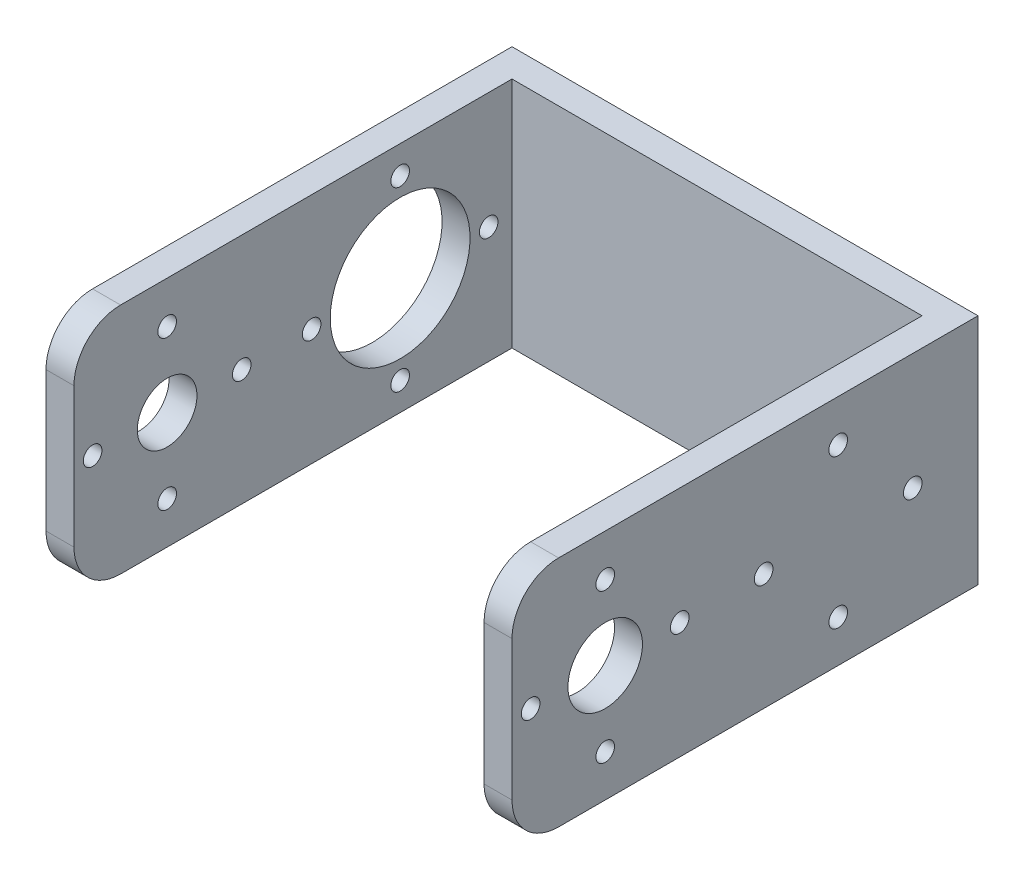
ISO-10303-21;
HEADER;
FILE_DESCRIPTION(('STEP AP214'),'2;1');
FILE_NAME('part.step','',(''),(''),'','','');
FILE_SCHEMA(('AUTOMOTIVE_DESIGN { 1 0 10303 214 1 1 1 1 }'));
ENDSEC;
DATA;
#1=APPLICATION_CONTEXT('core data for automotive mechanical design processes');
#2=APPLICATION_PROTOCOL_DEFINITION('international standard','automotive_design',2000,#1);
#3=PRODUCT_CONTEXT('',#1,'mechanical');
#4=PRODUCT('Part','Part','',(#3));
#5=PRODUCT_RELATED_PRODUCT_CATEGORY('part','',(#4));
#6=PRODUCT_DEFINITION_FORMATION('','',#4);
#7=PRODUCT_DEFINITION_CONTEXT('part definition',#1,'design');
#8=PRODUCT_DEFINITION('design','',#6,#7);
#9=PRODUCT_DEFINITION_SHAPE('','',#8);
#10=(LENGTH_UNIT() NAMED_UNIT(*) SI_UNIT(.MILLI.,.METRE.));
#11=(NAMED_UNIT(*) PLANE_ANGLE_UNIT() SI_UNIT($,.RADIAN.));
#12=(NAMED_UNIT(*) SI_UNIT($,.STERADIAN.) SOLID_ANGLE_UNIT());
#13=UNCERTAINTY_MEASURE_WITH_UNIT(LENGTH_MEASURE(1.E-05),#10,'distance_accuracy_value','');
#14=(GEOMETRIC_REPRESENTATION_CONTEXT(3) GLOBAL_UNCERTAINTY_ASSIGNED_CONTEXT((#13)) GLOBAL_UNIT_ASSIGNED_CONTEXT((#10,
#11,#12)) REPRESENTATION_CONTEXT('',''));
#15=CARTESIAN_POINT('',(0.,0.,0.));
#16=DIRECTION('',(0.,0.,1.));
#17=DIRECTION('',(1.,0.,0.));
#18=AXIS2_PLACEMENT_3D('',#15,#16,#17);
#19=CARTESIAN_POINT('',(27.,25.,-25.));
#20=DIRECTION('',(-1.,0.,0.));
#21=DIRECTION('',(0.,0.,1.));
#22=AXIS2_PLACEMENT_3D('',#19,#20,#21);
#23=PLANE('',#22);
#24=CARTESIAN_POINT('',(27.,12.5,15.));
#25=DIRECTION('',(1.,0.,0.));
#26=DIRECTION('',(0.,0.,-1.));
#27=AXIS2_PLACEMENT_3D('',#24,#25,#26);
#28=CIRCLE('',#27,4.);
#29=CARTESIAN_POINT('',(27.,12.5,11.));
#30=VERTEX_POINT('',#29);
#31=EDGE_CURVE('E315',#30,#30,#28,.T.);
#32=ORIENTED_EDGE('',*,*,#31,.F.);
#33=EDGE_LOOP('',(#32));
#34=FACE_BOUND('',#33,.T.);
#35=CARTESIAN_POINT('',(27.,4.5,-9.99999999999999));
#36=DIRECTION('',(1.,0.,0.));
#37=DIRECTION('',(0.,0.,-1.));
#38=AXIS2_PLACEMENT_3D('',#35,#36,#37);
#39=CIRCLE('',#38,1.);
#40=CARTESIAN_POINT('',(27.,4.5,-11.));
#41=VERTEX_POINT('',#40);
#42=EDGE_CURVE('E314',#41,#41,#39,.T.);
#43=ORIENTED_EDGE('',*,*,#42,.F.);
#44=EDGE_LOOP('',(#43));
#45=FACE_BOUND('',#44,.T.);
#46=CARTESIAN_POINT('',(27.,12.5,-2.));
#47=DIRECTION('',(1.,0.,0.));
#48=DIRECTION('',(0.,0.,-1.));
#49=AXIS2_PLACEMENT_3D('',#46,#47,#48);
#50=CIRCLE('',#49,1.);
#51=CARTESIAN_POINT('',(27.,12.5,-3.));
#52=VERTEX_POINT('',#51);
#53=EDGE_CURVE('E299',#52,#52,#50,.T.);
#54=ORIENTED_EDGE('',*,*,#53,.F.);
#55=EDGE_LOOP('',(#54));
#56=FACE_BOUND('',#55,.T.);
#57=CARTESIAN_POINT('',(27.,12.5,-18.));
#58=DIRECTION('',(1.,0.,0.));
#59=DIRECTION('',(0.,0.,-1.));
#60=AXIS2_PLACEMENT_3D('',#57,#58,#59);
#61=CIRCLE('',#60,1.);
#62=CARTESIAN_POINT('',(27.,12.5,-19.));
#63=VERTEX_POINT('',#62);
#64=EDGE_CURVE('E306',#63,#63,#61,.T.);
#65=ORIENTED_EDGE('',*,*,#64,.F.);
#66=EDGE_LOOP('',(#65));
#67=FACE_BOUND('',#66,.T.);
#68=CARTESIAN_POINT('',(27.,12.5,22.9999999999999));
#69=DIRECTION('',(1.,0.,0.));
#70=DIRECTION('',(0.,0.,-1.));
#71=AXIS2_PLACEMENT_3D('',#68,#69,#70);
#72=CIRCLE('',#71,1.);
#73=CARTESIAN_POINT('',(27.,12.5,21.9999999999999));
#74=VERTEX_POINT('',#73);
#75=EDGE_CURVE('E339',#74,#74,#72,.T.);
#76=ORIENTED_EDGE('',*,*,#75,.F.);
#77=EDGE_LOOP('',(#76));
#78=FACE_BOUND('',#77,.T.);
#79=CARTESIAN_POINT('',(27.,4.5,14.9999999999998));
#80=DIRECTION('',(1.,0.,0.));
#81=DIRECTION('',(0.,0.,-1.));
#82=AXIS2_PLACEMENT_3D('',#79,#80,#81);
#83=CIRCLE('',#82,1.);
#84=CARTESIAN_POINT('',(27.,4.5,13.9999999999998));
#85=VERTEX_POINT('',#84);
#86=EDGE_CURVE('E338',#85,#85,#83,.T.);
#87=ORIENTED_EDGE('',*,*,#86,.F.);
#88=EDGE_LOOP('',(#87));
#89=FACE_BOUND('',#88,.T.);
#90=CARTESIAN_POINT('',(27.,12.5000000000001,6.99999999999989));
#91=DIRECTION('',(1.,0.,0.));
#92=DIRECTION('',(0.,0.,-1.));
#93=AXIS2_PLACEMENT_3D('',#90,#91,#92);
#94=CIRCLE('',#93,1.);
#95=CARTESIAN_POINT('',(27.,12.5000000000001,5.99999999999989));
#96=VERTEX_POINT('',#95);
#97=EDGE_CURVE('E327',#96,#96,#94,.T.);
#98=ORIENTED_EDGE('',*,*,#97,.F.);
#99=EDGE_LOOP('',(#98));
#100=FACE_BOUND('',#99,.T.);
#101=CARTESIAN_POINT('',(27.,20.5,15.));
#102=DIRECTION('',(1.,0.,0.));
#103=DIRECTION('',(0.,0.,-1.));
#104=AXIS2_PLACEMENT_3D('',#101,#102,#103);
#105=CIRCLE('',#104,1.);
#106=CARTESIAN_POINT('',(27.,20.5,14.));
#107=VERTEX_POINT('',#106);
#108=EDGE_CURVE('E326',#107,#107,#105,.T.);
#109=ORIENTED_EDGE('',*,*,#108,.F.);
#110=EDGE_LOOP('',(#109));
#111=FACE_BOUND('',#110,.T.);
#112=CARTESIAN_POINT('',(27.,20.5,-10.));
#113=DIRECTION('',(1.,0.,0.));
#114=DIRECTION('',(0.,0.,-1.));
#115=AXIS2_PLACEMENT_3D('',#112,#113,#114);
#116=CIRCLE('',#115,1.);
#117=CARTESIAN_POINT('',(27.,20.5,-11.));
#118=VERTEX_POINT('',#117);
#119=EDGE_CURVE('E293',#118,#118,#116,.T.);
#120=ORIENTED_EDGE('',*,*,#119,.F.);
#121=EDGE_LOOP('',(#120));
#122=FACE_BOUND('',#121,.T.);
#123=DIRECTION('',(0.,-1.,0.));
#124=VECTOR('',#123,1.);
#125=CARTESIAN_POINT('',(27.,25.,25.));
#126=LINE('',#125,#124);
#127=CARTESIAN_POINT('',(27.,20.,25.));
#128=VERTEX_POINT('',#127);
#129=CARTESIAN_POINT('',(27.,5.,25.));
#130=VERTEX_POINT('',#129);
#131=EDGE_CURVE('E214',#128,#130,#126,.T.);
#132=ORIENTED_EDGE('',*,*,#131,.T.);
#133=CARTESIAN_POINT('',(27.,5.,20.));
#134=DIRECTION('',(-1.,0.,0.));
#135=DIRECTION('',(0.,0.,1.));
#136=AXIS2_PLACEMENT_3D('',#133,#134,#135);
#137=CIRCLE('',#136,5.);
#138=CARTESIAN_POINT('',(27.,0.,20.));
#139=VERTEX_POINT('',#138);
#140=EDGE_CURVE('E168',#130,#139,#137,.F.);
#141=ORIENTED_EDGE('',*,*,#140,.T.);
#142=DIRECTION('',(0.,0.,-1.));
#143=VECTOR('',#142,1.);
#144=CARTESIAN_POINT('',(27.,0.,-25.));
#145=LINE('',#144,#143);
#146=CARTESIAN_POINT('',(27.,0.,-25.));
#147=VERTEX_POINT('',#146);
#148=EDGE_CURVE('E154',#139,#147,#145,.T.);
#149=ORIENTED_EDGE('',*,*,#148,.T.);
#150=DIRECTION('',(0.,-1.,0.));
#151=VECTOR('',#150,1.);
#152=CARTESIAN_POINT('',(27.,25.,-25.));
#153=LINE('',#152,#151);
#154=CARTESIAN_POINT('',(27.,25.,-25.));
#155=VERTEX_POINT('',#154);
#156=EDGE_CURVE('E146',#155,#147,#153,.T.);
#157=ORIENTED_EDGE('',*,*,#156,.F.);
#158=DIRECTION('',(0.,0.,-1.));
#159=VECTOR('',#158,1.);
#160=CARTESIAN_POINT('',(27.,25.,-25.));
#161=LINE('',#160,#159);
#162=CARTESIAN_POINT('',(27.,25.,20.));
#163=VERTEX_POINT('',#162);
#164=EDGE_CURVE('E130',#163,#155,#161,.T.);
#165=ORIENTED_EDGE('',*,*,#164,.F.);
#166=CARTESIAN_POINT('',(27.,20.,20.));
#167=DIRECTION('',(-1.,0.,0.));
#168=DIRECTION('',(0.,0.,1.));
#169=AXIS2_PLACEMENT_3D('',#166,#167,#168);
#170=CIRCLE('',#169,5.);
#171=EDGE_CURVE('E166',#163,#128,#170,.F.);
#172=ORIENTED_EDGE('',*,*,#171,.T.);
#173=EDGE_LOOP('',(#132,#141,#149,#157,#165,#172));
#174=FACE_BOUND('',#173,.T.);
#175=ADVANCED_FACE('F41',(#34,#45,#56,#67,#78,#89,#100,#111,#122,#174),#23,.F.);
#176=CARTESIAN_POINT('',(-23.,25.,-25.));
#177=DIRECTION('',(0.,0.,1.));
#178=DIRECTION('',(1.,0.,0.));
#179=AXIS2_PLACEMENT_3D('',#176,#177,#178);
#180=PLANE('',#179);
#181=DIRECTION('',(-1.,0.,0.));
#182=VECTOR('',#181,1.);
#183=CARTESIAN_POINT('',(-23.,0.,-25.));
#184=LINE('',#183,#182);
#185=CARTESIAN_POINT('',(-23.,0.,-25.));
#186=VERTEX_POINT('',#185);
#187=EDGE_CURVE('E225',#147,#186,#184,.T.);
#188=ORIENTED_EDGE('',*,*,#187,.T.);
#189=DIRECTION('',(0.,-1.,0.));
#190=VECTOR('',#189,1.);
#191=CARTESIAN_POINT('',(-23.,25.,-25.));
#192=LINE('',#191,#190);
#193=CARTESIAN_POINT('',(-23.,25.,-25.));
#194=VERTEX_POINT('',#193);
#195=EDGE_CURVE('E148',#194,#186,#192,.T.);
#196=ORIENTED_EDGE('',*,*,#195,.F.);
#197=DIRECTION('',(-1.,0.,0.));
#198=VECTOR('',#197,1.);
#199=CARTESIAN_POINT('',(-23.,25.,-25.));
#200=LINE('',#199,#198);
#201=EDGE_CURVE('E135',#155,#194,#200,.T.);
#202=ORIENTED_EDGE('',*,*,#201,.F.);
#203=ORIENTED_EDGE('',*,*,#156,.T.);
#204=EDGE_LOOP('',(#188,#196,#202,#203));
#205=FACE_BOUND('',#204,.T.);
#206=ADVANCED_FACE('F145',(#205),#180,.F.);
#207=CARTESIAN_POINT('',(-23.,25.,25.));
#208=DIRECTION('',(1.,0.,0.));
#209=DIRECTION('',(0.,0.,-1.));
#210=AXIS2_PLACEMENT_3D('',#207,#208,#209);
#211=PLANE('',#210);
#212=CARTESIAN_POINT('',(-23.,12.5,-19.5));
#213=DIRECTION('',(-1.,0.,0.));
#214=DIRECTION('',(0.,0.,1.));
#215=AXIS2_PLACEMENT_3D('',#212,#213,#214);
#216=CIRCLE('',#215,1.);
#217=CARTESIAN_POINT('',(-23.,12.5,-18.5));
#218=VERTEX_POINT('',#217);
#219=EDGE_CURVE('E250',#218,#218,#216,.T.);
#220=ORIENTED_EDGE('',*,*,#219,.F.);
#221=EDGE_LOOP('',(#220));
#222=FACE_BOUND('',#221,.T.);
#223=CARTESIAN_POINT('',(-23.,3.,-10.));
#224=DIRECTION('',(-1.,0.,0.));
#225=DIRECTION('',(0.,0.,1.));
#226=AXIS2_PLACEMENT_3D('',#223,#224,#225);
#227=CIRCLE('',#226,1.);
#228=CARTESIAN_POINT('',(-23.,3.,-9.));
#229=VERTEX_POINT('',#228);
#230=EDGE_CURVE('E280',#229,#229,#227,.T.);
#231=ORIENTED_EDGE('',*,*,#230,.F.);
#232=EDGE_LOOP('',(#231));
#233=FACE_BOUND('',#232,.T.);
#234=CARTESIAN_POINT('',(-23.,12.5,-0.500000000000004));
#235=DIRECTION('',(-1.,0.,0.));
#236=DIRECTION('',(0.,0.,1.));
#237=AXIS2_PLACEMENT_3D('',#234,#235,#236);
#238=CIRCLE('',#237,1.);
#239=CARTESIAN_POINT('',(-23.,12.5,0.499999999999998));
#240=VERTEX_POINT('',#239);
#241=EDGE_CURVE('E269',#240,#240,#238,.T.);
#242=ORIENTED_EDGE('',*,*,#241,.F.);
#243=EDGE_LOOP('',(#242));
#244=FACE_BOUND('',#243,.T.);
#245=CARTESIAN_POINT('',(-23.,22.,-10.));
#246=DIRECTION('',(-1.,0.,0.));
#247=DIRECTION('',(0.,0.,1.));
#248=AXIS2_PLACEMENT_3D('',#245,#246,#247);
#249=CIRCLE('',#248,1.);
#250=CARTESIAN_POINT('',(-23.,22.,-9.));
#251=VERTEX_POINT('',#250);
#252=EDGE_CURVE('E268',#251,#251,#249,.T.);
#253=ORIENTED_EDGE('',*,*,#252,.F.);
#254=EDGE_LOOP('',(#253));
#255=FACE_BOUND('',#254,.T.);
#256=CARTESIAN_POINT('',(-23.,4.5,15.0000000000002));
#257=DIRECTION('',(-1.,0.,0.));
#258=DIRECTION('',(0.,0.,1.));
#259=AXIS2_PLACEMENT_3D('',#256,#257,#258);
#260=CIRCLE('',#259,1.);
#261=CARTESIAN_POINT('',(-23.,4.5,16.0000000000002));
#262=VERTEX_POINT('',#261);
#263=EDGE_CURVE('E257',#262,#262,#260,.T.);
#264=ORIENTED_EDGE('',*,*,#263,.F.);
#265=EDGE_LOOP('',(#264));
#266=FACE_BOUND('',#265,.T.);
#267=CARTESIAN_POINT('',(-23.,12.5000000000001,23.0000000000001));
#268=DIRECTION('',(-1.,0.,0.));
#269=DIRECTION('',(0.,0.,1.));
#270=AXIS2_PLACEMENT_3D('',#267,#268,#269);
#271=CIRCLE('',#270,1.);
#272=CARTESIAN_POINT('',(-23.,12.5000000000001,24.0000000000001));
#273=VERTEX_POINT('',#272);
#274=EDGE_CURVE('E256',#273,#273,#271,.T.);
#275=ORIENTED_EDGE('',*,*,#274,.F.);
#276=EDGE_LOOP('',(#275));
#277=FACE_BOUND('',#276,.T.);
#278=CARTESIAN_POINT('',(-23.,20.5,15.));
#279=DIRECTION('',(-1.,0.,0.));
#280=DIRECTION('',(0.,0.,1.));
#281=AXIS2_PLACEMENT_3D('',#278,#279,#280);
#282=CIRCLE('',#281,1.);
#283=CARTESIAN_POINT('',(-23.,20.5,16.));
#284=VERTEX_POINT('',#283);
#285=EDGE_CURVE('E243',#284,#284,#282,.T.);
#286=ORIENTED_EDGE('',*,*,#285,.F.);
#287=EDGE_LOOP('',(#286));
#288=FACE_BOUND('',#287,.T.);
#289=CARTESIAN_POINT('',(-23.,12.5,15.));
#290=DIRECTION('',(-1.,0.,0.));
#291=DIRECTION('',(0.,0.,1.));
#292=AXIS2_PLACEMENT_3D('',#289,#290,#291);
#293=CIRCLE('',#292,3.2);
#294=CARTESIAN_POINT('',(-23.,12.5,18.2));
#295=VERTEX_POINT('',#294);
#296=EDGE_CURVE('E242',#295,#295,#293,.T.);
#297=ORIENTED_EDGE('',*,*,#296,.F.);
#298=EDGE_LOOP('',(#297));
#299=FACE_BOUND('',#298,.T.);
#300=CARTESIAN_POINT('',(-23.,12.5,7.0000000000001));
#301=DIRECTION('',(-1.,0.,0.));
#302=DIRECTION('',(0.,0.,1.));
#303=AXIS2_PLACEMENT_3D('',#300,#301,#302);
#304=CIRCLE('',#303,1.);
#305=CARTESIAN_POINT('',(-23.,12.5,8.00000000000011));
#306=VERTEX_POINT('',#305);
#307=EDGE_CURVE('E289',#306,#306,#304,.T.);
#308=ORIENTED_EDGE('',*,*,#307,.F.);
#309=EDGE_LOOP('',(#308));
#310=FACE_BOUND('',#309,.T.);
#311=CARTESIAN_POINT('',(-23.,12.5,-10.));
#312=DIRECTION('',(-1.,0.,0.));
#313=DIRECTION('',(0.,0.,1.));
#314=AXIS2_PLACEMENT_3D('',#311,#312,#313);
#315=CIRCLE('',#314,7.5);
#316=CARTESIAN_POINT('',(-23.,12.5,-2.5));
#317=VERTEX_POINT('',#316);
#318=EDGE_CURVE('E235',#317,#317,#315,.T.);
#319=ORIENTED_EDGE('',*,*,#318,.F.);
#320=EDGE_LOOP('',(#319));
#321=FACE_BOUND('',#320,.T.);
#322=DIRECTION('',(0.,0.,1.));
#323=VECTOR('',#322,1.);
#324=CARTESIAN_POINT('',(-23.,0.,25.));
#325=LINE('',#324,#323);
#326=CARTESIAN_POINT('',(-23.,0.,20.));
#327=VERTEX_POINT('',#326);
#328=EDGE_CURVE('E223',#186,#327,#325,.T.);
#329=ORIENTED_EDGE('',*,*,#328,.T.);
#330=CARTESIAN_POINT('',(-23.,5.,20.));
#331=DIRECTION('',(1.,0.,0.));
#332=DIRECTION('',(0.,0.,-1.));
#333=AXIS2_PLACEMENT_3D('',#330,#331,#332);
#334=CIRCLE('',#333,5.);
#335=CARTESIAN_POINT('',(-23.,5.,25.));
#336=VERTEX_POINT('',#335);
#337=EDGE_CURVE('E11',#327,#336,#334,.F.);
#338=ORIENTED_EDGE('',*,*,#337,.T.);
#339=DIRECTION('',(0.,-1.,0.));
#340=VECTOR('',#339,1.);
#341=CARTESIAN_POINT('',(-23.,25.,25.));
#342=LINE('',#341,#340);
#343=CARTESIAN_POINT('',(-23.,20.,25.));
#344=VERTEX_POINT('',#343);
#345=EDGE_CURVE('E160',#344,#336,#342,.T.);
#346=ORIENTED_EDGE('',*,*,#345,.F.);
#347=CARTESIAN_POINT('',(-23.,20.,20.));
#348=DIRECTION('',(1.,0.,0.));
#349=DIRECTION('',(0.,0.,-1.));
#350=AXIS2_PLACEMENT_3D('',#347,#348,#349);
#351=CIRCLE('',#350,5.);
#352=CARTESIAN_POINT('',(-23.,25.,20.));
#353=VERTEX_POINT('',#352);
#354=EDGE_CURVE('E49',#344,#353,#351,.F.);
#355=ORIENTED_EDGE('',*,*,#354,.T.);
#356=DIRECTION('',(0.,0.,1.));
#357=VECTOR('',#356,1.);
#358=CARTESIAN_POINT('',(-23.,25.,25.));
#359=LINE('',#358,#357);
#360=EDGE_CURVE('E150',#194,#353,#359,.T.);
#361=ORIENTED_EDGE('',*,*,#360,.F.);
#362=ORIENTED_EDGE('',*,*,#195,.T.);
#363=EDGE_LOOP('',(#329,#338,#346,#355,#361,#362));
#364=FACE_BOUND('',#363,.T.);
#365=ADVANCED_FACE('F190',(#222,#233,#244,#255,#266,#277,#288,#299,#310,#321,#364),#211,.F.);
#366=CARTESIAN_POINT('',(-20.,25.,25.));
#367=DIRECTION('',(0.,0.,-1.));
#368=DIRECTION('',(-1.,0.,0.));
#369=AXIS2_PLACEMENT_3D('',#366,#367,#368);
#370=PLANE('',#369);
#371=ORIENTED_EDGE('',*,*,#345,.T.);
#372=DIRECTION('',(1.,0.,0.));
#373=VECTOR('',#372,1.);
#374=CARTESIAN_POINT('',(-20.,5.,25.));
#375=LINE('',#374,#373);
#376=CARTESIAN_POINT('',(-20.,5.,25.));
#377=VERTEX_POINT('',#376);
#378=EDGE_CURVE('E183',#336,#377,#375,.T.);
#379=ORIENTED_EDGE('',*,*,#378,.T.);
#380=DIRECTION('',(0.,-1.,0.));
#381=VECTOR('',#380,1.);
#382=CARTESIAN_POINT('',(-20.,25.,25.));
#383=LINE('',#382,#381);
#384=CARTESIAN_POINT('',(-20.,20.,25.));
#385=VERTEX_POINT('',#384);
#386=EDGE_CURVE('E199',#385,#377,#383,.T.);
#387=ORIENTED_EDGE('',*,*,#386,.F.);
#388=DIRECTION('',(1.,0.,0.));
#389=VECTOR('',#388,1.);
#390=CARTESIAN_POINT('',(-20.,20.,25.));
#391=LINE('',#390,#389);
#392=EDGE_CURVE('E61',#385,#344,#391,.F.);
#393=ORIENTED_EDGE('',*,*,#392,.T.);
#394=EDGE_LOOP('',(#371,#379,#387,#393));
#395=FACE_BOUND('',#394,.T.);
#396=ADVANCED_FACE('F201',(#395),#370,.F.);
#397=CARTESIAN_POINT('',(-20.,25.,-22.));
#398=DIRECTION('',(-1.,0.,0.));
#399=DIRECTION('',(0.,0.,1.));
#400=AXIS2_PLACEMENT_3D('',#397,#398,#399);
#401=PLANE('',#400);
#402=CARTESIAN_POINT('',(-20.,12.5,-19.5));
#403=DIRECTION('',(-1.,0.,0.));
#404=DIRECTION('',(0.,0.,1.));
#405=AXIS2_PLACEMENT_3D('',#402,#403,#404);
#406=CIRCLE('',#405,1.);
#407=CARTESIAN_POINT('',(-20.,12.5,-18.5));
#408=VERTEX_POINT('',#407);
#409=EDGE_CURVE('E277',#408,#408,#406,.F.);
#410=ORIENTED_EDGE('',*,*,#409,.F.);
#411=EDGE_LOOP('',(#410));
#412=FACE_BOUND('',#411,.T.);
#413=CARTESIAN_POINT('',(-20.,3.,-10.));
#414=DIRECTION('',(-1.,0.,0.));
#415=DIRECTION('',(0.,0.,1.));
#416=AXIS2_PLACEMENT_3D('',#413,#414,#415);
#417=CIRCLE('',#416,1.);
#418=CARTESIAN_POINT('',(-20.,3.,-9.));
#419=VERTEX_POINT('',#418);
#420=EDGE_CURVE('E272',#419,#419,#417,.F.);
#421=ORIENTED_EDGE('',*,*,#420,.F.);
#422=EDGE_LOOP('',(#421));
#423=FACE_BOUND('',#422,.T.);
#424=CARTESIAN_POINT('',(-20.,12.5,-0.500000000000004));
#425=DIRECTION('',(-1.,0.,0.));
#426=DIRECTION('',(0.,0.,1.));
#427=AXIS2_PLACEMENT_3D('',#424,#425,#426);
#428=CIRCLE('',#427,1.);
#429=CARTESIAN_POINT('',(-20.,12.5,0.499999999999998));
#430=VERTEX_POINT('',#429);
#431=EDGE_CURVE('E265',#430,#430,#428,.F.);
#432=ORIENTED_EDGE('',*,*,#431,.F.);
#433=EDGE_LOOP('',(#432));
#434=FACE_BOUND('',#433,.T.);
#435=CARTESIAN_POINT('',(-20.,22.,-10.));
#436=DIRECTION('',(-1.,0.,0.));
#437=DIRECTION('',(0.,0.,1.));
#438=AXIS2_PLACEMENT_3D('',#435,#436,#437);
#439=CIRCLE('',#438,1.);
#440=CARTESIAN_POINT('',(-20.,22.,-9.));
#441=VERTEX_POINT('',#440);
#442=EDGE_CURVE('E238',#441,#441,#439,.F.);
#443=ORIENTED_EDGE('',*,*,#442,.F.);
#444=EDGE_LOOP('',(#443));
#445=FACE_BOUND('',#444,.T.);
#446=CARTESIAN_POINT('',(-20.,4.5,15.0000000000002));
#447=DIRECTION('',(-1.,0.,0.));
#448=DIRECTION('',(0.,0.,1.));
#449=AXIS2_PLACEMENT_3D('',#446,#447,#448);
#450=CIRCLE('',#449,1.);
#451=CARTESIAN_POINT('',(-20.,4.5,16.0000000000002));
#452=VERTEX_POINT('',#451);
#453=EDGE_CURVE('E253',#452,#452,#450,.F.);
#454=ORIENTED_EDGE('',*,*,#453,.F.);
#455=EDGE_LOOP('',(#454));
#456=FACE_BOUND('',#455,.T.);
#457=CARTESIAN_POINT('',(-20.,12.5000000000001,23.0000000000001));
#458=DIRECTION('',(-1.,0.,0.));
#459=DIRECTION('',(0.,0.,1.));
#460=AXIS2_PLACEMENT_3D('',#457,#458,#459);
#461=CIRCLE('',#460,1.);
#462=CARTESIAN_POINT('',(-20.,12.5000000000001,24.0000000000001));
#463=VERTEX_POINT('',#462);
#464=EDGE_CURVE('E246',#463,#463,#461,.F.);
#465=ORIENTED_EDGE('',*,*,#464,.F.);
#466=EDGE_LOOP('',(#465));
#467=FACE_BOUND('',#466,.T.);
#468=CARTESIAN_POINT('',(-20.,20.5,15.));
#469=DIRECTION('',(-1.,0.,0.));
#470=DIRECTION('',(0.,0.,1.));
#471=AXIS2_PLACEMENT_3D('',#468,#469,#470);
#472=CIRCLE('',#471,1.);
#473=CARTESIAN_POINT('',(-20.,20.5,16.));
#474=VERTEX_POINT('',#473);
#475=EDGE_CURVE('E239',#474,#474,#472,.F.);
#476=ORIENTED_EDGE('',*,*,#475,.F.);
#477=EDGE_LOOP('',(#476));
#478=FACE_BOUND('',#477,.T.);
#479=CARTESIAN_POINT('',(-20.,12.5,15.));
#480=DIRECTION('',(-1.,0.,0.));
#481=DIRECTION('',(0.,0.,1.));
#482=AXIS2_PLACEMENT_3D('',#479,#480,#481);
#483=CIRCLE('',#482,3.2);
#484=CARTESIAN_POINT('',(-20.,12.5,18.2));
#485=VERTEX_POINT('',#484);
#486=EDGE_CURVE('E247',#485,#485,#483,.F.);
#487=ORIENTED_EDGE('',*,*,#486,.F.);
#488=EDGE_LOOP('',(#487));
#489=FACE_BOUND('',#488,.T.);
#490=CARTESIAN_POINT('',(-20.,12.5,7.0000000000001));
#491=DIRECTION('',(-1.,0.,0.));
#492=DIRECTION('',(0.,0.,1.));
#493=AXIS2_PLACEMENT_3D('',#490,#491,#492);
#494=CIRCLE('',#493,1.);
#495=CARTESIAN_POINT('',(-20.,12.5,8.00000000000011));
#496=VERTEX_POINT('',#495);
#497=EDGE_CURVE('E260',#496,#496,#494,.F.);
#498=ORIENTED_EDGE('',*,*,#497,.F.);
#499=EDGE_LOOP('',(#498));
#500=FACE_BOUND('',#499,.T.);
#501=CARTESIAN_POINT('',(-20.,12.5,-10.));
#502=DIRECTION('',(-1.,0.,0.));
#503=DIRECTION('',(0.,0.,1.));
#504=AXIS2_PLACEMENT_3D('',#501,#502,#503);
#505=CIRCLE('',#504,7.5);
#506=CARTESIAN_POINT('',(-20.,12.5,-2.5));
#507=VERTEX_POINT('',#506);
#508=EDGE_CURVE('E228',#507,#507,#505,.F.);
#509=ORIENTED_EDGE('',*,*,#508,.F.);
#510=EDGE_LOOP('',(#509));
#511=FACE_BOUND('',#510,.T.);
#512=ORIENTED_EDGE('',*,*,#386,.T.);
#513=CARTESIAN_POINT('',(-20.,5.,20.));
#514=DIRECTION('',(-1.,0.,0.));
#515=DIRECTION('',(0.,0.,1.));
#516=AXIS2_PLACEMENT_3D('',#513,#514,#515);
#517=CIRCLE('',#516,5.);
#518=CARTESIAN_POINT('',(-20.,0.,20.));
#519=VERTEX_POINT('',#518);
#520=EDGE_CURVE('E188',#377,#519,#517,.F.);
#521=ORIENTED_EDGE('',*,*,#520,.T.);
#522=DIRECTION('',(0.,0.,-1.));
#523=VECTOR('',#522,1.);
#524=CARTESIAN_POINT('',(-20.,0.,-22.));
#525=LINE('',#524,#523);
#526=CARTESIAN_POINT('',(-20.,0.,-22.));
#527=VERTEX_POINT('',#526);
#528=EDGE_CURVE('E221',#519,#527,#525,.T.);
#529=ORIENTED_EDGE('',*,*,#528,.T.);
#530=DIRECTION('',(0.,-1.,0.));
#531=VECTOR('',#530,1.);
#532=CARTESIAN_POINT('',(-20.,25.,-22.));
#533=LINE('',#532,#531);
#534=CARTESIAN_POINT('',(-20.,25.,-22.));
#535=VERTEX_POINT('',#534);
#536=EDGE_CURVE('E203',#535,#527,#533,.T.);
#537=ORIENTED_EDGE('',*,*,#536,.F.);
#538=DIRECTION('',(0.,0.,-1.));
#539=VECTOR('',#538,1.);
#540=CARTESIAN_POINT('',(-20.,25.,-22.));
#541=LINE('',#540,#539);
#542=CARTESIAN_POINT('',(-20.,25.,20.));
#543=VERTEX_POINT('',#542);
#544=EDGE_CURVE('E194',#543,#535,#541,.T.);
#545=ORIENTED_EDGE('',*,*,#544,.F.);
#546=CARTESIAN_POINT('',(-20.,20.,20.));
#547=DIRECTION('',(-1.,0.,0.));
#548=DIRECTION('',(0.,0.,1.));
#549=AXIS2_PLACEMENT_3D('',#546,#547,#548);
#550=CIRCLE('',#549,5.);
#551=EDGE_CURVE('E186',#543,#385,#550,.F.);
#552=ORIENTED_EDGE('',*,*,#551,.T.);
#553=EDGE_LOOP('',(#512,#521,#529,#537,#545,#552));
#554=FACE_BOUND('',#553,.T.);
#555=ADVANCED_FACE('F198',(#412,#423,#434,#445,#456,#467,#478,#489,#500,#511,#554),#401,.F.);
#556=CARTESIAN_POINT('',(24.,25.,-22.));
#557=DIRECTION('',(0.,0.,-1.));
#558=DIRECTION('',(-1.,0.,0.));
#559=AXIS2_PLACEMENT_3D('',#556,#557,#558);
#560=PLANE('',#559);
#561=DIRECTION('',(1.,0.,0.));
#562=VECTOR('',#561,1.);
#563=CARTESIAN_POINT('',(24.,0.,-22.));
#564=LINE('',#563,#562);
#565=CARTESIAN_POINT('',(24.,0.,-22.));
#566=VERTEX_POINT('',#565);
#567=EDGE_CURVE('E219',#527,#566,#564,.T.);
#568=ORIENTED_EDGE('',*,*,#567,.T.);
#569=DIRECTION('',(0.,-1.,0.));
#570=VECTOR('',#569,1.);
#571=CARTESIAN_POINT('',(24.,25.,-22.));
#572=LINE('',#571,#570);
#573=CARTESIAN_POINT('',(24.,25.,-22.));
#574=VERTEX_POINT('',#573);
#575=EDGE_CURVE('E206',#574,#566,#572,.T.);
#576=ORIENTED_EDGE('',*,*,#575,.F.);
#577=DIRECTION('',(1.,0.,0.));
#578=VECTOR('',#577,1.);
#579=CARTESIAN_POINT('',(24.,25.,-22.));
#580=LINE('',#579,#578);
#581=EDGE_CURVE('E230',#535,#574,#580,.T.);
#582=ORIENTED_EDGE('',*,*,#581,.F.);
#583=ORIENTED_EDGE('',*,*,#536,.T.);
#584=EDGE_LOOP('',(#568,#576,#582,#583));
#585=FACE_BOUND('',#584,.T.);
#586=ADVANCED_FACE('F372',(#585),#560,.F.);
#587=CARTESIAN_POINT('',(24.,25.,25.));
#588=DIRECTION('',(1.,0.,0.));
#589=DIRECTION('',(0.,0.,-1.));
#590=AXIS2_PLACEMENT_3D('',#587,#588,#589);
#591=PLANE('',#590);
#592=CARTESIAN_POINT('',(24.,12.5,15.));
#593=DIRECTION('',(1.,0.,0.));
#594=DIRECTION('',(0.,0.,-1.));
#595=AXIS2_PLACEMENT_3D('',#592,#593,#594);
#596=CIRCLE('',#595,4.);
#597=CARTESIAN_POINT('',(24.,12.5,11.));
#598=VERTEX_POINT('',#597);
#599=EDGE_CURVE('E311',#598,#598,#596,.F.);
#600=ORIENTED_EDGE('',*,*,#599,.F.);
#601=EDGE_LOOP('',(#600));
#602=FACE_BOUND('',#601,.T.);
#603=CARTESIAN_POINT('',(24.,4.5,-9.99999999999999));
#604=DIRECTION('',(1.,0.,0.));
#605=DIRECTION('',(0.,0.,-1.));
#606=AXIS2_PLACEMENT_3D('',#603,#604,#605);
#607=CIRCLE('',#606,1.);
#608=CARTESIAN_POINT('',(24.,4.5,-11.));
#609=VERTEX_POINT('',#608);
#610=EDGE_CURVE('E303',#609,#609,#607,.F.);
#611=ORIENTED_EDGE('',*,*,#610,.F.);
#612=EDGE_LOOP('',(#611));
#613=FACE_BOUND('',#612,.T.);
#614=CARTESIAN_POINT('',(24.,12.5,-2.));
#615=DIRECTION('',(1.,0.,0.));
#616=DIRECTION('',(0.,0.,-1.));
#617=AXIS2_PLACEMENT_3D('',#614,#615,#616);
#618=CIRCLE('',#617,1.);
#619=CARTESIAN_POINT('',(24.,12.5,-3.));
#620=VERTEX_POINT('',#619);
#621=EDGE_CURVE('E302',#620,#620,#618,.F.);
#622=ORIENTED_EDGE('',*,*,#621,.F.);
#623=EDGE_LOOP('',(#622));
#624=FACE_BOUND('',#623,.T.);
#625=CARTESIAN_POINT('',(24.,12.5,-18.));
#626=DIRECTION('',(1.,0.,0.));
#627=DIRECTION('',(0.,0.,-1.));
#628=AXIS2_PLACEMENT_3D('',#625,#626,#627);
#629=CIRCLE('',#628,1.);
#630=CARTESIAN_POINT('',(24.,12.5,-19.));
#631=VERTEX_POINT('',#630);
#632=EDGE_CURVE('E296',#631,#631,#629,.F.);
#633=ORIENTED_EDGE('',*,*,#632,.F.);
#634=EDGE_LOOP('',(#633));
#635=FACE_BOUND('',#634,.T.);
#636=CARTESIAN_POINT('',(24.,12.5,22.9999999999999));
#637=DIRECTION('',(1.,0.,0.));
#638=DIRECTION('',(0.,0.,-1.));
#639=AXIS2_PLACEMENT_3D('',#636,#637,#638);
#640=CIRCLE('',#639,1.);
#641=CARTESIAN_POINT('',(24.,12.5,21.9999999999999));
#642=VERTEX_POINT('',#641);
#643=EDGE_CURVE('E335',#642,#642,#640,.F.);
#644=ORIENTED_EDGE('',*,*,#643,.F.);
#645=EDGE_LOOP('',(#644));
#646=FACE_BOUND('',#645,.T.);
#647=CARTESIAN_POINT('',(24.,4.5,14.9999999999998));
#648=DIRECTION('',(1.,0.,0.));
#649=DIRECTION('',(0.,0.,-1.));
#650=AXIS2_PLACEMENT_3D('',#647,#648,#649);
#651=CIRCLE('',#650,1.);
#652=CARTESIAN_POINT('',(24.,4.5,13.9999999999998));
#653=VERTEX_POINT('',#652);
#654=EDGE_CURVE('E330',#653,#653,#651,.F.);
#655=ORIENTED_EDGE('',*,*,#654,.F.);
#656=EDGE_LOOP('',(#655));
#657=FACE_BOUND('',#656,.T.);
#658=CARTESIAN_POINT('',(24.,12.5000000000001,6.99999999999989));
#659=DIRECTION('',(1.,0.,0.));
#660=DIRECTION('',(0.,0.,-1.));
#661=AXIS2_PLACEMENT_3D('',#658,#659,#660);
#662=CIRCLE('',#661,1.);
#663=CARTESIAN_POINT('',(24.,12.5000000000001,5.99999999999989));
#664=VERTEX_POINT('',#663);
#665=EDGE_CURVE('E323',#664,#664,#662,.F.);
#666=ORIENTED_EDGE('',*,*,#665,.F.);
#667=EDGE_LOOP('',(#666));
#668=FACE_BOUND('',#667,.T.);
#669=CARTESIAN_POINT('',(24.,20.5,15.));
#670=DIRECTION('',(1.,0.,0.));
#671=DIRECTION('',(0.,0.,-1.));
#672=AXIS2_PLACEMENT_3D('',#669,#670,#671);
#673=CIRCLE('',#672,1.);
#674=CARTESIAN_POINT('',(24.,20.5,14.));
#675=VERTEX_POINT('',#674);
#676=EDGE_CURVE('E318',#675,#675,#673,.F.);
#677=ORIENTED_EDGE('',*,*,#676,.F.);
#678=EDGE_LOOP('',(#677));
#679=FACE_BOUND('',#678,.T.);
#680=CARTESIAN_POINT('',(24.,20.5,-10.));
#681=DIRECTION('',(1.,0.,0.));
#682=DIRECTION('',(0.,0.,-1.));
#683=AXIS2_PLACEMENT_3D('',#680,#681,#682);
#684=CIRCLE('',#683,1.);
#685=CARTESIAN_POINT('',(24.,20.5,-11.));
#686=VERTEX_POINT('',#685);
#687=EDGE_CURVE('E292',#686,#686,#684,.F.);
#688=ORIENTED_EDGE('',*,*,#687,.F.);
#689=EDGE_LOOP('',(#688));
#690=FACE_BOUND('',#689,.T.);
#691=DIRECTION('',(0.,0.,1.));
#692=VECTOR('',#691,1.);
#693=CARTESIAN_POINT('',(24.,0.,25.));
#694=LINE('',#693,#692);
#695=CARTESIAN_POINT('',(24.,0.,20.));
#696=VERTEX_POINT('',#695);
#697=EDGE_CURVE('E141',#566,#696,#694,.T.);
#698=ORIENTED_EDGE('',*,*,#697,.T.);
#699=CARTESIAN_POINT('',(24.,5.,20.));
#700=DIRECTION('',(1.,0.,0.));
#701=DIRECTION('',(0.,0.,-1.));
#702=AXIS2_PLACEMENT_3D('',#699,#700,#701);
#703=CIRCLE('',#702,5.);
#704=CARTESIAN_POINT('',(24.,5.,25.));
#705=VERTEX_POINT('',#704);
#706=EDGE_CURVE('E176',#696,#705,#703,.F.);
#707=ORIENTED_EDGE('',*,*,#706,.T.);
#708=DIRECTION('',(0.,-1.,0.));
#709=VECTOR('',#708,1.);
#710=CARTESIAN_POINT('',(24.,25.,25.));
#711=LINE('',#710,#709);
#712=CARTESIAN_POINT('',(24.,20.,25.));
#713=VERTEX_POINT('',#712);
#714=EDGE_CURVE('E211',#713,#705,#711,.T.);
#715=ORIENTED_EDGE('',*,*,#714,.F.);
#716=CARTESIAN_POINT('',(24.,20.,20.));
#717=DIRECTION('',(1.,0.,0.));
#718=DIRECTION('',(0.,0.,-1.));
#719=AXIS2_PLACEMENT_3D('',#716,#717,#718);
#720=CIRCLE('',#719,5.);
#721=CARTESIAN_POINT('',(24.,25.,20.));
#722=VERTEX_POINT('',#721);
#723=EDGE_CURVE('E174',#713,#722,#720,.F.);
#724=ORIENTED_EDGE('',*,*,#723,.T.);
#725=DIRECTION('',(0.,0.,1.));
#726=VECTOR('',#725,1.);
#727=CARTESIAN_POINT('',(24.,25.,25.));
#728=LINE('',#727,#726);
#729=EDGE_CURVE('E216',#574,#722,#728,.T.);
#730=ORIENTED_EDGE('',*,*,#729,.F.);
#731=ORIENTED_EDGE('',*,*,#575,.T.);
#732=EDGE_LOOP('',(#698,#707,#715,#724,#730,#731));
#733=FACE_BOUND('',#732,.T.);
#734=ADVANCED_FACE('F368',(#602,#613,#624,#635,#646,#657,#668,#679,#690,#733),#591,.F.);
#735=CARTESIAN_POINT('',(27.,25.,25.));
#736=DIRECTION('',(0.,0.,-1.));
#737=DIRECTION('',(-1.,0.,0.));
#738=AXIS2_PLACEMENT_3D('',#735,#736,#737);
#739=PLANE('',#738);
#740=ORIENTED_EDGE('',*,*,#714,.T.);
#741=DIRECTION('',(1.,0.,0.));
#742=VECTOR('',#741,1.);
#743=CARTESIAN_POINT('',(27.,5.,25.));
#744=LINE('',#743,#742);
#745=EDGE_CURVE('E158',#705,#130,#744,.T.);
#746=ORIENTED_EDGE('',*,*,#745,.T.);
#747=ORIENTED_EDGE('',*,*,#131,.F.);
#748=DIRECTION('',(1.,0.,0.));
#749=VECTOR('',#748,1.);
#750=CARTESIAN_POINT('',(27.,20.,25.));
#751=LINE('',#750,#749);
#752=EDGE_CURVE('E156',#128,#713,#751,.F.);
#753=ORIENTED_EDGE('',*,*,#752,.T.);
#754=EDGE_LOOP('',(#740,#746,#747,#753));
#755=FACE_BOUND('',#754,.T.);
#756=ADVANCED_FACE('F371',(#755),#739,.F.);
#757=CARTESIAN_POINT('',(0.,25.,0.));
#758=DIRECTION('',(0.,-1.,0.));
#759=DIRECTION('',(0.,0.,-1.));
#760=AXIS2_PLACEMENT_3D('',#757,#758,#759);
#761=PLANE('',#760);
#762=ORIENTED_EDGE('',*,*,#729,.T.);
#763=DIRECTION('',(1.,0.,0.));
#764=VECTOR('',#763,1.);
#765=CARTESIAN_POINT('',(0.,25.,20.));
#766=LINE('',#765,#764);
#767=EDGE_CURVE('E138',#722,#163,#766,.T.);
#768=ORIENTED_EDGE('',*,*,#767,.T.);
#769=ORIENTED_EDGE('',*,*,#164,.T.);
#770=ORIENTED_EDGE('',*,*,#201,.T.);
#771=ORIENTED_EDGE('',*,*,#360,.T.);
#772=DIRECTION('',(1.,0.,0.));
#773=VECTOR('',#772,1.);
#774=CARTESIAN_POINT('',(0.,25.,20.));
#775=LINE('',#774,#773);
#776=EDGE_CURVE('E178',#353,#543,#775,.T.);
#777=ORIENTED_EDGE('',*,*,#776,.T.);
#778=ORIENTED_EDGE('',*,*,#544,.T.);
#779=ORIENTED_EDGE('',*,*,#581,.T.);
#780=EDGE_LOOP('',(#762,#768,#769,#770,#771,#777,#778,#779));
#781=FACE_BOUND('',#780,.T.);
#782=ADVANCED_FACE('F133',(#781),#761,.F.);
#783=CARTESIAN_POINT('',(0.,0.,0.));
#784=DIRECTION('',(0.,-1.,0.));
#785=DIRECTION('',(0.,0.,-1.));
#786=AXIS2_PLACEMENT_3D('',#783,#784,#785);
#787=PLANE('',#786);
#788=ORIENTED_EDGE('',*,*,#148,.F.);
#789=DIRECTION('',(1.,0.,0.));
#790=VECTOR('',#789,1.);
#791=CARTESIAN_POINT('',(24.,0.,20.));
#792=LINE('',#791,#790);
#793=EDGE_CURVE('E172',#139,#696,#792,.F.);
#794=ORIENTED_EDGE('',*,*,#793,.T.);
#795=ORIENTED_EDGE('',*,*,#697,.F.);
#796=ORIENTED_EDGE('',*,*,#567,.F.);
#797=ORIENTED_EDGE('',*,*,#528,.F.);
#798=DIRECTION('',(1.,0.,0.));
#799=VECTOR('',#798,1.);
#800=CARTESIAN_POINT('',(-23.,0.,20.));
#801=LINE('',#800,#799);
#802=EDGE_CURVE('E170',#519,#327,#801,.F.);
#803=ORIENTED_EDGE('',*,*,#802,.T.);
#804=ORIENTED_EDGE('',*,*,#328,.F.);
#805=ORIENTED_EDGE('',*,*,#187,.F.);
#806=EDGE_LOOP('',(#788,#794,#795,#796,#797,#803,#804,#805));
#807=FACE_BOUND('',#806,.T.);
#808=ADVANCED_FACE('F395',(#807),#787,.T.);
#809=CARTESIAN_POINT('',(27.001,12.5,-10.));
#810=DIRECTION('',(-1.,0.,0.));
#811=DIRECTION('',(0.,0.,1.));
#812=AXIS2_PLACEMENT_3D('',#809,#810,#811);
#813=CYLINDRICAL_SURFACE('',#812,7.5);
#814=ORIENTED_EDGE('',*,*,#318,.T.);
#815=EDGE_LOOP('',(#814));
#816=FACE_BOUND('',#815,.T.);
#817=ORIENTED_EDGE('',*,*,#508,.T.);
#818=EDGE_LOOP('',(#817));
#819=FACE_BOUND('',#818,.T.);
#820=ADVANCED_FACE('F426',(#816,#819),#813,.F.);
#821=CARTESIAN_POINT('',(27.001,12.5,7.0000000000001));
#822=DIRECTION('',(-1.,0.,0.));
#823=DIRECTION('',(0.,0.,1.));
#824=AXIS2_PLACEMENT_3D('',#821,#822,#823);
#825=CYLINDRICAL_SURFACE('',#824,1.);
#826=ORIENTED_EDGE('',*,*,#307,.T.);
#827=EDGE_LOOP('',(#826));
#828=FACE_BOUND('',#827,.T.);
#829=ORIENTED_EDGE('',*,*,#497,.T.);
#830=EDGE_LOOP('',(#829));
#831=FACE_BOUND('',#830,.T.);
#832=ADVANCED_FACE('F431',(#828,#831),#825,.F.);
#833=CARTESIAN_POINT('',(27.001,12.5,15.));
#834=DIRECTION('',(-1.,0.,0.));
#835=DIRECTION('',(0.,0.,1.));
#836=AXIS2_PLACEMENT_3D('',#833,#834,#835);
#837=CYLINDRICAL_SURFACE('',#836,3.2);
#838=ORIENTED_EDGE('',*,*,#296,.T.);
#839=EDGE_LOOP('',(#838));
#840=FACE_BOUND('',#839,.T.);
#841=ORIENTED_EDGE('',*,*,#486,.T.);
#842=EDGE_LOOP('',(#841));
#843=FACE_BOUND('',#842,.T.);
#844=ADVANCED_FACE('F437',(#840,#843),#837,.F.);
#845=CARTESIAN_POINT('',(27.001,20.5,15.));
#846=DIRECTION('',(-1.,0.,0.));
#847=DIRECTION('',(0.,0.,1.));
#848=AXIS2_PLACEMENT_3D('',#845,#846,#847);
#849=CYLINDRICAL_SURFACE('',#848,1.);
#850=ORIENTED_EDGE('',*,*,#285,.T.);
#851=EDGE_LOOP('',(#850));
#852=FACE_BOUND('',#851,.T.);
#853=ORIENTED_EDGE('',*,*,#475,.T.);
#854=EDGE_LOOP('',(#853));
#855=FACE_BOUND('',#854,.T.);
#856=ADVANCED_FACE('F433',(#852,#855),#849,.F.);
#857=CARTESIAN_POINT('',(27.001,12.5000000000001,23.0000000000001));
#858=DIRECTION('',(-1.,0.,0.));
#859=DIRECTION('',(0.,0.,1.));
#860=AXIS2_PLACEMENT_3D('',#857,#858,#859);
#861=CYLINDRICAL_SURFACE('',#860,1.);
#862=ORIENTED_EDGE('',*,*,#274,.T.);
#863=EDGE_LOOP('',(#862));
#864=FACE_BOUND('',#863,.T.);
#865=ORIENTED_EDGE('',*,*,#464,.T.);
#866=EDGE_LOOP('',(#865));
#867=FACE_BOUND('',#866,.T.);
#868=ADVANCED_FACE('F436',(#864,#867),#861,.F.);
#869=CARTESIAN_POINT('',(27.001,4.5,15.0000000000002));
#870=DIRECTION('',(-1.,0.,0.));
#871=DIRECTION('',(0.,0.,1.));
#872=AXIS2_PLACEMENT_3D('',#869,#870,#871);
#873=CYLINDRICAL_SURFACE('',#872,1.);
#874=ORIENTED_EDGE('',*,*,#263,.T.);
#875=EDGE_LOOP('',(#874));
#876=FACE_BOUND('',#875,.T.);
#877=ORIENTED_EDGE('',*,*,#453,.T.);
#878=EDGE_LOOP('',(#877));
#879=FACE_BOUND('',#878,.T.);
#880=ADVANCED_FACE('F442',(#876,#879),#873,.F.);
#881=CARTESIAN_POINT('',(27.001,22.,-10.));
#882=DIRECTION('',(-1.,0.,0.));
#883=DIRECTION('',(0.,0.,1.));
#884=AXIS2_PLACEMENT_3D('',#881,#882,#883);
#885=CYLINDRICAL_SURFACE('',#884,1.);
#886=ORIENTED_EDGE('',*,*,#252,.T.);
#887=EDGE_LOOP('',(#886));
#888=FACE_BOUND('',#887,.T.);
#889=ORIENTED_EDGE('',*,*,#442,.T.);
#890=EDGE_LOOP('',(#889));
#891=FACE_BOUND('',#890,.T.);
#892=ADVANCED_FACE('F445',(#888,#891),#885,.F.);
#893=CARTESIAN_POINT('',(27.001,12.5,-0.500000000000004));
#894=DIRECTION('',(-1.,0.,0.));
#895=DIRECTION('',(0.,0.,1.));
#896=AXIS2_PLACEMENT_3D('',#893,#894,#895);
#897=CYLINDRICAL_SURFACE('',#896,1.);
#898=ORIENTED_EDGE('',*,*,#241,.T.);
#899=EDGE_LOOP('',(#898));
#900=FACE_BOUND('',#899,.T.);
#901=ORIENTED_EDGE('',*,*,#431,.T.);
#902=EDGE_LOOP('',(#901));
#903=FACE_BOUND('',#902,.T.);
#904=ADVANCED_FACE('F450',(#900,#903),#897,.F.);
#905=CARTESIAN_POINT('',(27.001,3.,-10.));
#906=DIRECTION('',(-1.,0.,0.));
#907=DIRECTION('',(0.,0.,1.));
#908=AXIS2_PLACEMENT_3D('',#905,#906,#907);
#909=CYLINDRICAL_SURFACE('',#908,1.);
#910=ORIENTED_EDGE('',*,*,#230,.T.);
#911=EDGE_LOOP('',(#910));
#912=FACE_BOUND('',#911,.T.);
#913=ORIENTED_EDGE('',*,*,#420,.T.);
#914=EDGE_LOOP('',(#913));
#915=FACE_BOUND('',#914,.T.);
#916=ADVANCED_FACE('F453',(#912,#915),#909,.F.);
#917=CARTESIAN_POINT('',(27.001,12.5,-19.5));
#918=DIRECTION('',(-1.,0.,0.));
#919=DIRECTION('',(0.,0.,1.));
#920=AXIS2_PLACEMENT_3D('',#917,#918,#919);
#921=CYLINDRICAL_SURFACE('',#920,1.);
#922=ORIENTED_EDGE('',*,*,#219,.T.);
#923=EDGE_LOOP('',(#922));
#924=FACE_BOUND('',#923,.T.);
#925=ORIENTED_EDGE('',*,*,#409,.T.);
#926=EDGE_LOOP('',(#925));
#927=FACE_BOUND('',#926,.T.);
#928=ADVANCED_FACE('F364',(#924,#927),#921,.F.);
#929=CARTESIAN_POINT('',(-23.001,20.5,-9.99999999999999));
#930=DIRECTION('',(1.,0.,0.));
#931=DIRECTION('',(0.,0.,-1.));
#932=AXIS2_PLACEMENT_3D('',#929,#930,#931);
#933=CYLINDRICAL_SURFACE('',#932,1.);
#934=ORIENTED_EDGE('',*,*,#119,.T.);
#935=EDGE_LOOP('',(#934));
#936=FACE_BOUND('',#935,.T.);
#937=ORIENTED_EDGE('',*,*,#687,.T.);
#938=EDGE_LOOP('',(#937));
#939=FACE_BOUND('',#938,.T.);
#940=ADVANCED_FACE('F360',(#936,#939),#933,.F.);
#941=CARTESIAN_POINT('',(-23.001,20.5,15.));
#942=DIRECTION('',(1.,0.,0.));
#943=DIRECTION('',(0.,0.,-1.));
#944=AXIS2_PLACEMENT_3D('',#941,#942,#943);
#945=CYLINDRICAL_SURFACE('',#944,1.);
#946=ORIENTED_EDGE('',*,*,#108,.T.);
#947=EDGE_LOOP('',(#946));
#948=FACE_BOUND('',#947,.T.);
#949=ORIENTED_EDGE('',*,*,#676,.T.);
#950=EDGE_LOOP('',(#949));
#951=FACE_BOUND('',#950,.T.);
#952=ADVANCED_FACE('F363',(#948,#951),#945,.F.);
#953=CARTESIAN_POINT('',(-23.001,12.5000000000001,6.9999999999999));
#954=DIRECTION('',(1.,0.,0.));
#955=DIRECTION('',(0.,0.,-1.));
#956=AXIS2_PLACEMENT_3D('',#953,#954,#955);
#957=CYLINDRICAL_SURFACE('',#956,1.);
#958=ORIENTED_EDGE('',*,*,#97,.T.);
#959=EDGE_LOOP('',(#958));
#960=FACE_BOUND('',#959,.T.);
#961=ORIENTED_EDGE('',*,*,#665,.T.);
#962=EDGE_LOOP('',(#961));
#963=FACE_BOUND('',#962,.T.);
#964=ADVANCED_FACE('F483',(#960,#963),#957,.F.);
#965=CARTESIAN_POINT('',(-23.001,4.5,14.9999999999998));
#966=DIRECTION('',(1.,0.,0.));
#967=DIRECTION('',(0.,0.,-1.));
#968=AXIS2_PLACEMENT_3D('',#965,#966,#967);
#969=CYLINDRICAL_SURFACE('',#968,1.);
#970=ORIENTED_EDGE('',*,*,#86,.T.);
#971=EDGE_LOOP('',(#970));
#972=FACE_BOUND('',#971,.T.);
#973=ORIENTED_EDGE('',*,*,#654,.T.);
#974=EDGE_LOOP('',(#973));
#975=FACE_BOUND('',#974,.T.);
#976=ADVANCED_FACE('F347',(#972,#975),#969,.F.);
#977=CARTESIAN_POINT('',(-23.001,12.5,22.9999999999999));
#978=DIRECTION('',(1.,0.,0.));
#979=DIRECTION('',(0.,0.,-1.));
#980=AXIS2_PLACEMENT_3D('',#977,#978,#979);
#981=CYLINDRICAL_SURFACE('',#980,1.);
#982=ORIENTED_EDGE('',*,*,#75,.T.);
#983=EDGE_LOOP('',(#982));
#984=FACE_BOUND('',#983,.T.);
#985=ORIENTED_EDGE('',*,*,#643,.T.);
#986=EDGE_LOOP('',(#985));
#987=FACE_BOUND('',#986,.T.);
#988=ADVANCED_FACE('F475',(#984,#987),#981,.F.);
#989=CARTESIAN_POINT('',(-23.001,12.5,-18.));
#990=DIRECTION('',(1.,0.,0.));
#991=DIRECTION('',(0.,0.,-1.));
#992=AXIS2_PLACEMENT_3D('',#989,#990,#991);
#993=CYLINDRICAL_SURFACE('',#992,1.);
#994=ORIENTED_EDGE('',*,*,#64,.T.);
#995=EDGE_LOOP('',(#994));
#996=FACE_BOUND('',#995,.T.);
#997=ORIENTED_EDGE('',*,*,#632,.T.);
#998=EDGE_LOOP('',(#997));
#999=FACE_BOUND('',#998,.T.);
#1000=ADVANCED_FACE('F471',(#996,#999),#993,.F.);
#1001=CARTESIAN_POINT('',(-23.001,12.5,-1.99999999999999));
#1002=DIRECTION('',(1.,0.,0.));
#1003=DIRECTION('',(0.,0.,-1.));
#1004=AXIS2_PLACEMENT_3D('',#1001,#1002,#1003);
#1005=CYLINDRICAL_SURFACE('',#1004,1.);
#1006=ORIENTED_EDGE('',*,*,#53,.T.);
#1007=EDGE_LOOP('',(#1006));
#1008=FACE_BOUND('',#1007,.T.);
#1009=ORIENTED_EDGE('',*,*,#621,.T.);
#1010=EDGE_LOOP('',(#1009));
#1011=FACE_BOUND('',#1010,.T.);
#1012=ADVANCED_FACE('F467',(#1008,#1011),#1005,.F.);
#1013=CARTESIAN_POINT('',(-23.001,4.5,-9.99999999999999));
#1014=DIRECTION('',(1.,0.,0.));
#1015=DIRECTION('',(0.,0.,-1.));
#1016=AXIS2_PLACEMENT_3D('',#1013,#1014,#1015);
#1017=CYLINDRICAL_SURFACE('',#1016,1.);
#1018=ORIENTED_EDGE('',*,*,#42,.T.);
#1019=EDGE_LOOP('',(#1018));
#1020=FACE_BOUND('',#1019,.T.);
#1021=ORIENTED_EDGE('',*,*,#610,.T.);
#1022=EDGE_LOOP('',(#1021));
#1023=FACE_BOUND('',#1022,.T.);
#1024=ADVANCED_FACE('F470',(#1020,#1023),#1017,.F.);
#1025=CARTESIAN_POINT('',(-23.001,12.5,15.));
#1026=DIRECTION('',(1.,0.,0.));
#1027=DIRECTION('',(0.,0.,-1.));
#1028=AXIS2_PLACEMENT_3D('',#1025,#1026,#1027);
#1029=CYLINDRICAL_SURFACE('',#1028,4.);
#1030=ORIENTED_EDGE('',*,*,#31,.T.);
#1031=EDGE_LOOP('',(#1030));
#1032=FACE_BOUND('',#1031,.T.);
#1033=ORIENTED_EDGE('',*,*,#599,.T.);
#1034=EDGE_LOOP('',(#1033));
#1035=FACE_BOUND('',#1034,.T.);
#1036=ADVANCED_FACE('F408',(#1032,#1035),#1029,.F.);
#1037=CARTESIAN_POINT('',(27.,5.,20.));
#1038=DIRECTION('',(-1.,0.,0.));
#1039=DIRECTION('',(0.,0.,1.));
#1040=AXIS2_PLACEMENT_3D('',#1037,#1038,#1039);
#1041=CYLINDRICAL_SURFACE('',#1040,5.);
#1042=ORIENTED_EDGE('',*,*,#706,.F.);
#1043=ORIENTED_EDGE('',*,*,#793,.F.);
#1044=ORIENTED_EDGE('',*,*,#140,.F.);
#1045=ORIENTED_EDGE('',*,*,#745,.F.);
#1046=EDGE_LOOP('',(#1042,#1043,#1044,#1045));
#1047=FACE_BOUND('',#1046,.T.);
#1048=ADVANCED_FACE('F385',(#1047),#1041,.T.);
#1049=CARTESIAN_POINT('',(0.,20.,20.));
#1050=DIRECTION('',(1.,0.,0.));
#1051=DIRECTION('',(0.,0.,-1.));
#1052=AXIS2_PLACEMENT_3D('',#1049,#1050,#1051);
#1053=CYLINDRICAL_SURFACE('',#1052,5.);
#1054=ORIENTED_EDGE('',*,*,#723,.F.);
#1055=ORIENTED_EDGE('',*,*,#752,.F.);
#1056=ORIENTED_EDGE('',*,*,#171,.F.);
#1057=ORIENTED_EDGE('',*,*,#767,.F.);
#1058=EDGE_LOOP('',(#1054,#1055,#1056,#1057));
#1059=FACE_BOUND('',#1058,.T.);
#1060=ADVANCED_FACE('F391',(#1059),#1053,.T.);
#1061=CARTESIAN_POINT('',(-20.,5.,20.));
#1062=DIRECTION('',(-1.,0.,0.));
#1063=DIRECTION('',(0.,0.,1.));
#1064=AXIS2_PLACEMENT_3D('',#1061,#1062,#1063);
#1065=CYLINDRICAL_SURFACE('',#1064,5.);
#1066=ORIENTED_EDGE('',*,*,#337,.F.);
#1067=ORIENTED_EDGE('',*,*,#802,.F.);
#1068=ORIENTED_EDGE('',*,*,#520,.F.);
#1069=ORIENTED_EDGE('',*,*,#378,.F.);
#1070=EDGE_LOOP('',(#1066,#1067,#1068,#1069));
#1071=FACE_BOUND('',#1070,.T.);
#1072=ADVANCED_FACE('F399',(#1071),#1065,.T.);
#1073=CARTESIAN_POINT('',(0.,20.,20.));
#1074=DIRECTION('',(1.,0.,0.));
#1075=DIRECTION('',(0.,0.,-1.));
#1076=AXIS2_PLACEMENT_3D('',#1073,#1074,#1075);
#1077=CYLINDRICAL_SURFACE('',#1076,5.);
#1078=ORIENTED_EDGE('',*,*,#354,.F.);
#1079=ORIENTED_EDGE('',*,*,#392,.F.);
#1080=ORIENTED_EDGE('',*,*,#551,.F.);
#1081=ORIENTED_EDGE('',*,*,#776,.F.);
#1082=EDGE_LOOP('',(#1078,#1079,#1080,#1081));
#1083=FACE_BOUND('',#1082,.T.);
#1084=ADVANCED_FACE('F43',(#1083),#1077,.T.);
#1085=CLOSED_SHELL('',(#175,#206,#365,#396,#555,#586,#734,#756,#782,#808,#820,#832,#844,#856,
#868,#880,#892,#904,#916,#928,#940,#952,#964,#976,#988,#1000,#1012,#1024,#1036,#1048,#1060,
#1072,#1084));
#1086=MANIFOLD_SOLID_BREP('B2',#1085);
#1087=ADVANCED_BREP_SHAPE_REPRESENTATION('',(#18,#1086),#14);
#1088=SHAPE_DEFINITION_REPRESENTATION(#9,#1087);
ENDSEC;
END-ISO-10303-21;
